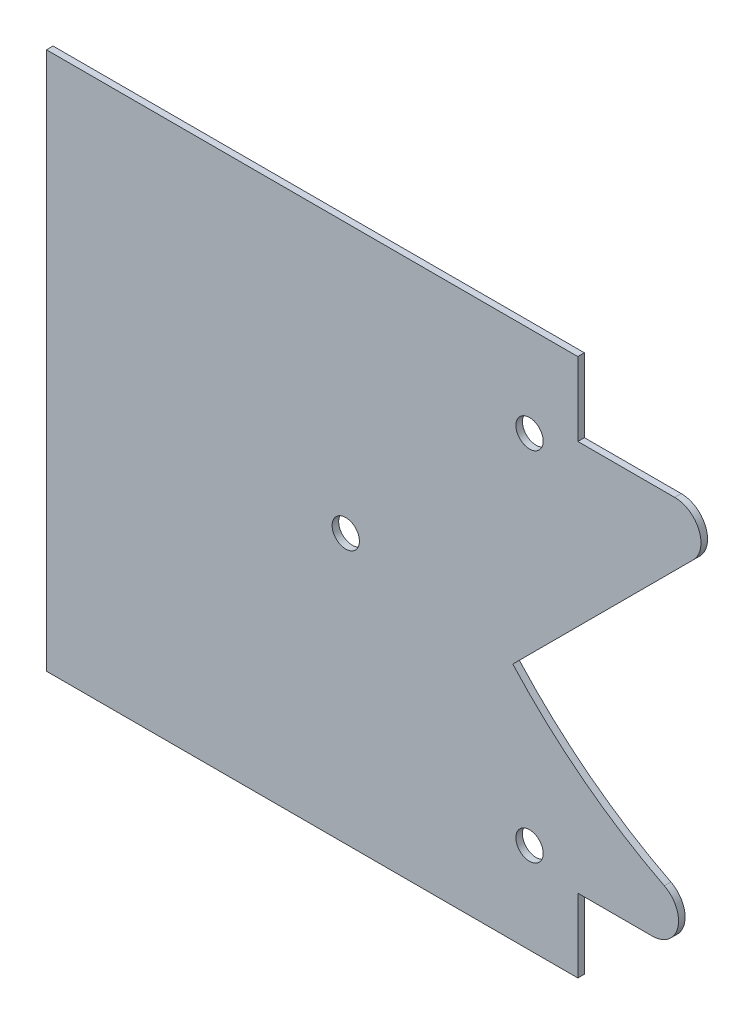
ISO-10303-21;
HEADER;
FILE_DESCRIPTION(('STEP AP214'),'2;1');
FILE_NAME('part.step','',(''),(''),'','','');
FILE_SCHEMA(('AUTOMOTIVE_DESIGN { 1 0 10303 214 1 1 1 1 }'));
ENDSEC;
DATA;
#1=APPLICATION_CONTEXT('core data for automotive mechanical design processes');
#2=APPLICATION_PROTOCOL_DEFINITION('international standard','automotive_design',2000,#1);
#3=PRODUCT_CONTEXT('',#1,'mechanical');
#4=PRODUCT('Part','Part','',(#3));
#5=PRODUCT_RELATED_PRODUCT_CATEGORY('part','',(#4));
#6=PRODUCT_DEFINITION_FORMATION('','',#4);
#7=PRODUCT_DEFINITION_CONTEXT('part definition',#1,'design');
#8=PRODUCT_DEFINITION('design','',#6,#7);
#9=PRODUCT_DEFINITION_SHAPE('','',#8);
#10=(LENGTH_UNIT() NAMED_UNIT(*) SI_UNIT(.MILLI.,.METRE.));
#11=(NAMED_UNIT(*) PLANE_ANGLE_UNIT() SI_UNIT($,.RADIAN.));
#12=(NAMED_UNIT(*) SI_UNIT($,.STERADIAN.) SOLID_ANGLE_UNIT());
#13=UNCERTAINTY_MEASURE_WITH_UNIT(LENGTH_MEASURE(1.E-05),#10,'distance_accuracy_value','');
#14=(GEOMETRIC_REPRESENTATION_CONTEXT(3) GLOBAL_UNCERTAINTY_ASSIGNED_CONTEXT((#13)) GLOBAL_UNIT_ASSIGNED_CONTEXT((#10,
#11,#12)) REPRESENTATION_CONTEXT('',''));
#15=CARTESIAN_POINT('',(0.,0.,0.));
#16=DIRECTION('',(0.,0.,1.));
#17=DIRECTION('',(1.,0.,0.));
#18=AXIS2_PLACEMENT_3D('',#15,#16,#17);
#19=CARTESIAN_POINT('',(0.,0.,0.79375));
#20=DIRECTION('',(0.,0.,-1.));
#21=DIRECTION('',(-1.,0.,0.));
#22=AXIS2_PLACEMENT_3D('',#19,#20,#21);
#23=PLANE('',#22);
#24=CARTESIAN_POINT('',(-67.945,0.,0.79375));
#25=DIRECTION('',(0.,0.,1.));
#26=DIRECTION('',(1.,0.,0.));
#27=AXIS2_PLACEMENT_3D('',#24,#25,#26);
#28=CIRCLE('',#27,1.65100000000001);
#29=CARTESIAN_POINT('',(-66.294,0.,0.79375));
#30=VERTEX_POINT('',#29);
#31=EDGE_CURVE('E152',#30,#30,#28,.T.);
#32=ORIENTED_EDGE('',*,*,#31,.F.);
#33=EDGE_LOOP('',(#32));
#34=FACE_BOUND('',#33,.T.);
#35=CARTESIAN_POINT('',(-45.72,-21.59,0.79375));
#36=DIRECTION('',(0.,0.,1.));
#37=DIRECTION('',(1.,0.,0.));
#38=AXIS2_PLACEMENT_3D('',#35,#36,#37);
#39=CIRCLE('',#38,1.651);
#40=CARTESIAN_POINT('',(-44.069,-21.59,0.79375));
#41=VERTEX_POINT('',#40);
#42=EDGE_CURVE('E174',#41,#41,#39,.T.);
#43=ORIENTED_EDGE('',*,*,#42,.F.);
#44=EDGE_LOOP('',(#43));
#45=FACE_BOUND('',#44,.T.);
#46=CARTESIAN_POINT('',(-45.72,21.59,0.79375));
#47=DIRECTION('',(0.,0.,1.));
#48=DIRECTION('',(1.,0.,0.));
#49=AXIS2_PLACEMENT_3D('',#46,#47,#48);
#50=CIRCLE('',#49,1.651);
#51=CARTESIAN_POINT('',(-44.069,21.59,0.79375));
#52=VERTEX_POINT('',#51);
#53=EDGE_CURVE('E180',#52,#52,#50,.T.);
#54=ORIENTED_EDGE('',*,*,#53,.F.);
#55=EDGE_LOOP('',(#54));
#56=FACE_BOUND('',#55,.T.);
#57=DIRECTION('',(1.,0.,0.));
#58=VECTOR('',#57,1.);
#59=CARTESIAN_POINT('',(0.,-23.65375,0.79375));
#60=LINE('',#59,#58);
#61=CARTESIAN_POINT('',(-39.878,-23.65375,0.79375));
#62=VERTEX_POINT('',#61);
#63=CARTESIAN_POINT('',(-30.8711406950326,-23.65375,0.79375));
#64=VERTEX_POINT('',#63);
#65=EDGE_CURVE('E133',#62,#64,#60,.T.);
#66=ORIENTED_EDGE('',*,*,#65,.T.);
#67=CARTESIAN_POINT('',(-30.8711406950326,-20.47875,0.79375));
#68=DIRECTION('',(0.,0.,-1.));
#69=DIRECTION('',(-1.,0.,0.));
#70=AXIS2_PLACEMENT_3D('',#67,#68,#69);
#71=CIRCLE('',#70,3.175);
#72=CARTESIAN_POINT('',(-29.4211106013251,-17.6542079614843,0.79375));
#73=VERTEX_POINT('',#72);
#74=EDGE_CURVE('E212',#64,#73,#71,.F.);
#75=ORIENTED_EDGE('',*,*,#74,.T.);
#76=CARTESIAN_POINT('',(0.,39.65575,0.79375));
#77=DIRECTION('',(0.,0.,1.));
#78=DIRECTION('',(1.,0.,0.));
#79=AXIS2_PLACEMENT_3D('',#76,#77,#78);
#80=CIRCLE('',#79,64.42075);
#81=CARTESIAN_POINT('',(-47.7420551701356,-3.5961771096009,0.79375));
#82=VERTEX_POINT('',#81);
#83=EDGE_CURVE('E164',#82,#73,#80,.T.);
#84=ORIENTED_EDGE('',*,*,#83,.F.);
#85=DIRECTION('',(-0.707106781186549,-0.707106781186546,0.));
#86=VECTOR('',#85,1.);
#87=CARTESIAN_POINT('',(-4.49012806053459,39.65575,0.79375));
#88=LINE('',#87,#86);
#89=CARTESIAN_POINT('',(-25.9121920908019,18.2336859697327,0.79375));
#90=VERTEX_POINT('',#89);
#91=EDGE_CURVE('E129',#90,#82,#88,.T.);
#92=ORIENTED_EDGE('',*,*,#91,.F.);
#93=CARTESIAN_POINT('',(-28.1572561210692,20.47875,0.79375));
#94=DIRECTION('',(0.,0.,-1.));
#95=DIRECTION('',(-1.,0.,0.));
#96=AXIS2_PLACEMENT_3D('',#93,#94,#95);
#97=CIRCLE('',#96,3.175);
#98=CARTESIAN_POINT('',(-28.1572561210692,23.65375,0.79375));
#99=VERTEX_POINT('',#98);
#100=EDGE_CURVE('E51',#90,#99,#97,.F.);
#101=ORIENTED_EDGE('',*,*,#100,.T.);
#102=DIRECTION('',(1.,0.,0.));
#103=VECTOR('',#102,1.);
#104=CARTESIAN_POINT('',(0.,23.65375,0.79375));
#105=LINE('',#104,#103);
#106=CARTESIAN_POINT('',(-39.878,23.65375,0.79375));
#107=VERTEX_POINT('',#106);
#108=EDGE_CURVE('E138',#107,#99,#105,.T.);
#109=ORIENTED_EDGE('',*,*,#108,.F.);
#110=DIRECTION('',(0.,-1.,0.));
#111=VECTOR('',#110,1.);
#112=CARTESIAN_POINT('',(-39.878,0.,0.79375));
#113=LINE('',#112,#111);
#114=CARTESIAN_POINT('',(-39.878,32.54375,0.79375));
#115=VERTEX_POINT('',#114);
#116=EDGE_CURVE('E143',#115,#107,#113,.T.);
#117=ORIENTED_EDGE('',*,*,#116,.F.);
#118=DIRECTION('',(-1.,0.,0.));
#119=VECTOR('',#118,1.);
#120=CARTESIAN_POINT('',(48.895,32.54375,0.79375));
#121=LINE('',#120,#119);
#122=CARTESIAN_POINT('',(-104.14,32.54375,0.79375));
#123=VERTEX_POINT('',#122);
#124=EDGE_CURVE('E186',#115,#123,#121,.T.);
#125=ORIENTED_EDGE('',*,*,#124,.T.);
#126=DIRECTION('',(0.,-1.,0.));
#127=VECTOR('',#126,1.);
#128=CARTESIAN_POINT('',(-104.14,32.54375,0.79375));
#129=LINE('',#128,#127);
#130=CARTESIAN_POINT('',(-104.14,-32.54375,0.79375));
#131=VERTEX_POINT('',#130);
#132=EDGE_CURVE('E188',#123,#131,#129,.T.);
#133=ORIENTED_EDGE('',*,*,#132,.T.);
#134=DIRECTION('',(1.,0.,0.));
#135=VECTOR('',#134,1.);
#136=CARTESIAN_POINT('',(48.895,-32.54375,0.79375));
#137=LINE('',#136,#135);
#138=CARTESIAN_POINT('',(-39.878,-32.54375,0.79375));
#139=VERTEX_POINT('',#138);
#140=EDGE_CURVE('E142',#131,#139,#137,.T.);
#141=ORIENTED_EDGE('',*,*,#140,.T.);
#142=EDGE_CURVE('E122',#62,#139,#113,.T.);
#143=ORIENTED_EDGE('',*,*,#142,.F.);
#144=EDGE_LOOP('',(#66,#75,#84,#92,#101,#109,#117,#125,#133,#141,#143));
#145=FACE_BOUND('',#144,.T.);
#146=ADVANCED_FACE('F36',(#34,#45,#56,#145),#23,.F.);
#147=CARTESIAN_POINT('',(0.,0.,0.));
#148=DIRECTION('',(0.,0.,-1.));
#149=DIRECTION('',(-1.,0.,0.));
#150=AXIS2_PLACEMENT_3D('',#147,#148,#149);
#151=PLANE('',#150);
#152=CARTESIAN_POINT('',(-67.945,0.,0.));
#153=DIRECTION('',(0.,0.,1.));
#154=DIRECTION('',(1.,0.,0.));
#155=AXIS2_PLACEMENT_3D('',#152,#153,#154);
#156=CIRCLE('',#155,1.65100000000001);
#157=CARTESIAN_POINT('',(-66.294,0.,0.));
#158=VERTEX_POINT('',#157);
#159=EDGE_CURVE('E228',#158,#158,#156,.T.);
#160=ORIENTED_EDGE('',*,*,#159,.T.);
#161=EDGE_LOOP('',(#160));
#162=FACE_BOUND('',#161,.T.);
#163=CARTESIAN_POINT('',(0.,39.65575,0.));
#164=DIRECTION('',(0.,0.,1.));
#165=DIRECTION('',(-1.,0.,0.));
#166=AXIS2_PLACEMENT_3D('',#163,#164,#165);
#167=CIRCLE('',#166,64.42075);
#168=CARTESIAN_POINT('',(-47.7420551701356,-3.5961771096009,0.));
#169=VERTEX_POINT('',#168);
#170=CARTESIAN_POINT('',(-29.4211106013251,-17.6542079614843,0.));
#171=VERTEX_POINT('',#170);
#172=EDGE_CURVE('E163',#169,#171,#167,.T.);
#173=ORIENTED_EDGE('',*,*,#172,.T.);
#174=CARTESIAN_POINT('',(-30.8711406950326,-20.47875,0.));
#175=DIRECTION('',(0.,0.,-1.));
#176=DIRECTION('',(-1.,0.,0.));
#177=AXIS2_PLACEMENT_3D('',#174,#175,#176);
#178=CIRCLE('',#177,3.175);
#179=CARTESIAN_POINT('',(-30.8711406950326,-23.65375,0.));
#180=VERTEX_POINT('',#179);
#181=EDGE_CURVE('E208',#171,#180,#178,.T.);
#182=ORIENTED_EDGE('',*,*,#181,.T.);
#183=DIRECTION('',(1.,0.,0.));
#184=VECTOR('',#183,1.);
#185=CARTESIAN_POINT('',(0.,-23.65375,0.));
#186=LINE('',#185,#184);
#187=CARTESIAN_POINT('',(-39.878,-23.65375,0.));
#188=VERTEX_POINT('',#187);
#189=EDGE_CURVE('E151',#188,#180,#186,.T.);
#190=ORIENTED_EDGE('',*,*,#189,.F.);
#191=DIRECTION('',(0.,-1.,0.));
#192=VECTOR('',#191,1.);
#193=CARTESIAN_POINT('',(-39.878,0.,0.));
#194=LINE('',#193,#192);
#195=CARTESIAN_POINT('',(-39.878,-32.54375,0.));
#196=VERTEX_POINT('',#195);
#197=EDGE_CURVE('E125',#188,#196,#194,.T.);
#198=ORIENTED_EDGE('',*,*,#197,.T.);
#199=DIRECTION('',(1.,0.,0.));
#200=VECTOR('',#199,1.);
#201=CARTESIAN_POINT('',(48.895,-32.54375,0.));
#202=LINE('',#201,#200);
#203=CARTESIAN_POINT('',(-104.14,-32.54375,0.));
#204=VERTEX_POINT('',#203);
#205=EDGE_CURVE('E189',#204,#196,#202,.T.);
#206=ORIENTED_EDGE('',*,*,#205,.F.);
#207=DIRECTION('',(0.,-1.,0.));
#208=VECTOR('',#207,1.);
#209=CARTESIAN_POINT('',(-104.14,32.54375,0.));
#210=LINE('',#209,#208);
#211=CARTESIAN_POINT('',(-104.14,32.54375,0.));
#212=VERTEX_POINT('',#211);
#213=EDGE_CURVE('E194',#212,#204,#210,.T.);
#214=ORIENTED_EDGE('',*,*,#213,.F.);
#215=DIRECTION('',(-1.,0.,0.));
#216=VECTOR('',#215,1.);
#217=CARTESIAN_POINT('',(48.895,32.54375,0.));
#218=LINE('',#217,#216);
#219=CARTESIAN_POINT('',(-39.878,32.54375,0.));
#220=VERTEX_POINT('',#219);
#221=EDGE_CURVE('E183',#220,#212,#218,.T.);
#222=ORIENTED_EDGE('',*,*,#221,.F.);
#223=CARTESIAN_POINT('',(-39.878,23.65375,0.));
#224=VERTEX_POINT('',#223);
#225=EDGE_CURVE('E155',#220,#224,#194,.T.);
#226=ORIENTED_EDGE('',*,*,#225,.T.);
#227=DIRECTION('',(1.,0.,0.));
#228=VECTOR('',#227,1.);
#229=CARTESIAN_POINT('',(0.,23.65375,0.));
#230=LINE('',#229,#228);
#231=CARTESIAN_POINT('',(-28.1572561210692,23.65375,0.));
#232=VERTEX_POINT('',#231);
#233=EDGE_CURVE('E148',#224,#232,#230,.T.);
#234=ORIENTED_EDGE('',*,*,#233,.T.);
#235=CARTESIAN_POINT('',(-28.1572561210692,20.47875,0.));
#236=DIRECTION('',(0.,0.,-1.));
#237=DIRECTION('',(-1.,0.,0.));
#238=AXIS2_PLACEMENT_3D('',#235,#236,#237);
#239=CIRCLE('',#238,3.175);
#240=CARTESIAN_POINT('',(-25.9121920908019,18.2336859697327,0.));
#241=VERTEX_POINT('',#240);
#242=EDGE_CURVE('E206',#232,#241,#239,.T.);
#243=ORIENTED_EDGE('',*,*,#242,.T.);
#244=DIRECTION('',(-0.707106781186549,-0.707106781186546,0.));
#245=VECTOR('',#244,1.);
#246=CARTESIAN_POINT('',(-4.49012806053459,39.65575,0.));
#247=LINE('',#246,#245);
#248=EDGE_CURVE('E161',#241,#169,#247,.T.);
#249=ORIENTED_EDGE('',*,*,#248,.T.);
#250=EDGE_LOOP('',(#173,#182,#190,#198,#206,#214,#222,#226,#234,#243,#249));
#251=FACE_BOUND('',#250,.T.);
#252=CARTESIAN_POINT('',(-45.72,-21.59,0.));
#253=DIRECTION('',(0.,0.,1.));
#254=DIRECTION('',(1.,0.,0.));
#255=AXIS2_PLACEMENT_3D('',#252,#253,#254);
#256=CIRCLE('',#255,1.651);
#257=CARTESIAN_POINT('',(-44.069,-21.59,0.));
#258=VERTEX_POINT('',#257);
#259=EDGE_CURVE('E173',#258,#258,#256,.T.);
#260=ORIENTED_EDGE('',*,*,#259,.T.);
#261=EDGE_LOOP('',(#260));
#262=FACE_BOUND('',#261,.T.);
#263=CARTESIAN_POINT('',(-45.72,21.59,0.));
#264=DIRECTION('',(0.,0.,1.));
#265=DIRECTION('',(1.,0.,0.));
#266=AXIS2_PLACEMENT_3D('',#263,#264,#265);
#267=CIRCLE('',#266,1.651);
#268=CARTESIAN_POINT('',(-44.069,21.59,0.));
#269=VERTEX_POINT('',#268);
#270=EDGE_CURVE('E177',#269,#269,#267,.T.);
#271=ORIENTED_EDGE('',*,*,#270,.T.);
#272=EDGE_LOOP('',(#271));
#273=FACE_BOUND('',#272,.T.);
#274=ADVANCED_FACE('F222',(#162,#251,#262,#273),#151,.T.);
#275=CARTESIAN_POINT('',(48.895,32.54375,0.79375));
#276=DIRECTION('',(0.,-1.,0.));
#277=DIRECTION('',(1.,0.,0.));
#278=AXIS2_PLACEMENT_3D('',#275,#276,#277);
#279=PLANE('',#278);
#280=DIRECTION('',(0.,0.,-1.));
#281=VECTOR('',#280,1.);
#282=CARTESIAN_POINT('',(-39.878,32.54375,0.79375));
#283=LINE('',#282,#281);
#284=EDGE_CURVE('E157',#115,#220,#283,.T.);
#285=ORIENTED_EDGE('',*,*,#284,.T.);
#286=ORIENTED_EDGE('',*,*,#221,.T.);
#287=DIRECTION('',(0.,0.,-1.));
#288=VECTOR('',#287,1.);
#289=CARTESIAN_POINT('',(-104.14,32.54375,0.79375));
#290=LINE('',#289,#288);
#291=EDGE_CURVE('E200',#123,#212,#290,.T.);
#292=ORIENTED_EDGE('',*,*,#291,.F.);
#293=ORIENTED_EDGE('',*,*,#124,.F.);
#294=EDGE_LOOP('',(#285,#286,#292,#293));
#295=FACE_BOUND('',#294,.T.);
#296=ADVANCED_FACE('F253',(#295),#279,.F.);
#297=CARTESIAN_POINT('',(48.895,-32.54375,0.79375));
#298=DIRECTION('',(0.,1.,0.));
#299=DIRECTION('',(-1.,0.,0.));
#300=AXIS2_PLACEMENT_3D('',#297,#298,#299);
#301=PLANE('',#300);
#302=DIRECTION('',(0.,0.,-1.));
#303=VECTOR('',#302,1.);
#304=CARTESIAN_POINT('',(-39.878,-32.54375,0.79375));
#305=LINE('',#304,#303);
#306=EDGE_CURVE('E130',#139,#196,#305,.T.);
#307=ORIENTED_EDGE('',*,*,#306,.F.);
#308=ORIENTED_EDGE('',*,*,#140,.F.);
#309=DIRECTION('',(0.,0.,-1.));
#310=VECTOR('',#309,1.);
#311=CARTESIAN_POINT('',(-104.14,-32.54375,0.79375));
#312=LINE('',#311,#310);
#313=EDGE_CURVE('E192',#131,#204,#312,.T.);
#314=ORIENTED_EDGE('',*,*,#313,.T.);
#315=ORIENTED_EDGE('',*,*,#205,.T.);
#316=EDGE_LOOP('',(#307,#308,#314,#315));
#317=FACE_BOUND('',#316,.T.);
#318=ADVANCED_FACE('F259',(#317),#301,.F.);
#319=CARTESIAN_POINT('',(-4.49012806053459,39.65575,0.));
#320=DIRECTION('',(-0.707106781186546,0.707106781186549,0.));
#321=DIRECTION('',(-0.707106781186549,-0.707106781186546,0.));
#322=AXIS2_PLACEMENT_3D('',#319,#320,#321);
#323=PLANE('',#322);
#324=ORIENTED_EDGE('',*,*,#248,.F.);
#325=DIRECTION('',(0.,0.,-1.));
#326=VECTOR('',#325,1.);
#327=CARTESIAN_POINT('',(-25.9121920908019,18.2336859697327,0.79375));
#328=LINE('',#327,#326);
#329=EDGE_CURVE('E11',#241,#90,#328,.F.);
#330=ORIENTED_EDGE('',*,*,#329,.T.);
#331=ORIENTED_EDGE('',*,*,#91,.T.);
#332=DIRECTION('',(0.,0.,1.));
#333=VECTOR('',#332,1.);
#334=CARTESIAN_POINT('',(-47.7420551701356,-3.5961771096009,0.));
#335=LINE('',#334,#333);
#336=EDGE_CURVE('E167',#169,#82,#335,.T.);
#337=ORIENTED_EDGE('',*,*,#336,.F.);
#338=EDGE_LOOP('',(#324,#330,#331,#337));
#339=FACE_BOUND('',#338,.T.);
#340=ADVANCED_FACE('F265',(#339),#323,.F.);
#341=CARTESIAN_POINT('',(-104.14,32.54375,0.79375));
#342=DIRECTION('',(1.,0.,0.));
#343=DIRECTION('',(0.,0.,-1.));
#344=AXIS2_PLACEMENT_3D('',#341,#342,#343);
#345=PLANE('',#344);
#346=ORIENTED_EDGE('',*,*,#213,.T.);
#347=ORIENTED_EDGE('',*,*,#313,.F.);
#348=ORIENTED_EDGE('',*,*,#132,.F.);
#349=ORIENTED_EDGE('',*,*,#291,.T.);
#350=EDGE_LOOP('',(#346,#347,#348,#349));
#351=FACE_BOUND('',#350,.T.);
#352=ADVANCED_FACE('F248',(#351),#345,.F.);
#353=CARTESIAN_POINT('',(-45.72,21.59,0.79375));
#354=DIRECTION('',(0.,0.,-1.));
#355=DIRECTION('',(-1.,0.,0.));
#356=AXIS2_PLACEMENT_3D('',#353,#354,#355);
#357=CYLINDRICAL_SURFACE('',#356,1.651);
#358=ORIENTED_EDGE('',*,*,#53,.T.);
#359=EDGE_LOOP('',(#358));
#360=FACE_BOUND('',#359,.T.);
#361=ORIENTED_EDGE('',*,*,#270,.F.);
#362=EDGE_LOOP('',(#361));
#363=FACE_BOUND('',#362,.T.);
#364=ADVANCED_FACE('F244',(#360,#363),#357,.F.);
#365=CARTESIAN_POINT('',(-45.72,-21.59,0.79375));
#366=DIRECTION('',(0.,0.,-1.));
#367=DIRECTION('',(-1.,0.,0.));
#368=AXIS2_PLACEMENT_3D('',#365,#366,#367);
#369=CYLINDRICAL_SURFACE('',#368,1.651);
#370=ORIENTED_EDGE('',*,*,#42,.T.);
#371=EDGE_LOOP('',(#370));
#372=FACE_BOUND('',#371,.T.);
#373=ORIENTED_EDGE('',*,*,#259,.F.);
#374=EDGE_LOOP('',(#373));
#375=FACE_BOUND('',#374,.T.);
#376=ADVANCED_FACE('F247',(#372,#375),#369,.F.);
#377=CARTESIAN_POINT('',(0.,39.65575,0.));
#378=DIRECTION('',(0.,0.,1.));
#379=DIRECTION('',(1.,0.,0.));
#380=AXIS2_PLACEMENT_3D('',#377,#378,#379);
#381=CYLINDRICAL_SURFACE('',#380,64.42075);
#382=ORIENTED_EDGE('',*,*,#83,.T.);
#383=DIRECTION('',(0.,0.,1.));
#384=VECTOR('',#383,1.);
#385=CARTESIAN_POINT('',(-29.4211106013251,-17.6542079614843,0.));
#386=LINE('',#385,#384);
#387=EDGE_CURVE('E203',#73,#171,#386,.F.);
#388=ORIENTED_EDGE('',*,*,#387,.T.);
#389=ORIENTED_EDGE('',*,*,#172,.F.);
#390=ORIENTED_EDGE('',*,*,#336,.T.);
#391=EDGE_LOOP('',(#382,#388,#389,#390));
#392=FACE_BOUND('',#391,.T.);
#393=ADVANCED_FACE('F281',(#392),#381,.F.);
#394=CARTESIAN_POINT('',(0.,-23.65375,0.79375));
#395=DIRECTION('',(0.,1.,0.));
#396=DIRECTION('',(0.,0.,1.));
#397=AXIS2_PLACEMENT_3D('',#394,#395,#396);
#398=PLANE('',#397);
#399=ORIENTED_EDGE('',*,*,#189,.T.);
#400=DIRECTION('',(0.,0.,1.));
#401=VECTOR('',#400,1.);
#402=CARTESIAN_POINT('',(-30.8711406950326,-23.65375,0.79375));
#403=LINE('',#402,#401);
#404=EDGE_CURVE('E136',#180,#64,#403,.T.);
#405=ORIENTED_EDGE('',*,*,#404,.T.);
#406=ORIENTED_EDGE('',*,*,#65,.F.);
#407=DIRECTION('',(0.,0.,-1.));
#408=VECTOR('',#407,1.);
#409=CARTESIAN_POINT('',(-39.878,-23.65375,0.79375));
#410=LINE('',#409,#408);
#411=EDGE_CURVE('E118',#62,#188,#410,.T.);
#412=ORIENTED_EDGE('',*,*,#411,.T.);
#413=EDGE_LOOP('',(#399,#405,#406,#412));
#414=FACE_BOUND('',#413,.T.);
#415=ADVANCED_FACE('F134',(#414),#398,.F.);
#416=CARTESIAN_POINT('',(-39.878,0.,0.79375));
#417=DIRECTION('',(1.,0.,0.));
#418=DIRECTION('',(0.,1.,0.));
#419=AXIS2_PLACEMENT_3D('',#416,#417,#418);
#420=PLANE('',#419);
#421=ORIENTED_EDGE('',*,*,#197,.F.);
#422=ORIENTED_EDGE('',*,*,#411,.F.);
#423=ORIENTED_EDGE('',*,*,#142,.T.);
#424=ORIENTED_EDGE('',*,*,#306,.T.);
#425=EDGE_LOOP('',(#421,#422,#423,#424));
#426=FACE_BOUND('',#425,.T.);
#427=ADVANCED_FACE('F120',(#426),#420,.T.);
#428=CARTESIAN_POINT('',(0.,23.65375,0.79375));
#429=DIRECTION('',(0.,1.,0.));
#430=DIRECTION('',(0.,0.,1.));
#431=AXIS2_PLACEMENT_3D('',#428,#429,#430);
#432=PLANE('',#431);
#433=ORIENTED_EDGE('',*,*,#108,.T.);
#434=DIRECTION('',(0.,0.,-1.));
#435=VECTOR('',#434,1.);
#436=CARTESIAN_POINT('',(-28.1572561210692,23.65375,0.));
#437=LINE('',#436,#435);
#438=EDGE_CURVE('E44',#99,#232,#437,.T.);
#439=ORIENTED_EDGE('',*,*,#438,.T.);
#440=ORIENTED_EDGE('',*,*,#233,.F.);
#441=DIRECTION('',(0.,0.,-1.));
#442=VECTOR('',#441,1.);
#443=CARTESIAN_POINT('',(-39.878,23.65375,0.79375));
#444=LINE('',#443,#442);
#445=EDGE_CURVE('E145',#107,#224,#444,.T.);
#446=ORIENTED_EDGE('',*,*,#445,.F.);
#447=EDGE_LOOP('',(#433,#439,#440,#446));
#448=FACE_BOUND('',#447,.T.);
#449=ADVANCED_FACE('F217',(#448),#432,.T.);
#450=ORIENTED_EDGE('',*,*,#225,.F.);
#451=ORIENTED_EDGE('',*,*,#284,.F.);
#452=ORIENTED_EDGE('',*,*,#116,.T.);
#453=ORIENTED_EDGE('',*,*,#445,.T.);
#454=EDGE_LOOP('',(#450,#451,#452,#453));
#455=FACE_BOUND('',#454,.T.);
#456=ADVANCED_FACE('F276',(#455),#420,.T.);
#457=CARTESIAN_POINT('',(-67.945,0.,0.79375));
#458=DIRECTION('',(0.,0.,-1.));
#459=DIRECTION('',(-1.,0.,0.));
#460=AXIS2_PLACEMENT_3D('',#457,#458,#459);
#461=CYLINDRICAL_SURFACE('',#460,1.65100000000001);
#462=ORIENTED_EDGE('',*,*,#31,.T.);
#463=EDGE_LOOP('',(#462));
#464=FACE_BOUND('',#463,.T.);
#465=ORIENTED_EDGE('',*,*,#159,.F.);
#466=EDGE_LOOP('',(#465));
#467=FACE_BOUND('',#466,.T.);
#468=ADVANCED_FACE('F234',(#464,#467),#461,.F.);
#469=CARTESIAN_POINT('',(-30.8711406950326,-20.47875,0.));
#470=DIRECTION('',(0.,0.,1.));
#471=DIRECTION('',(1.,0.,0.));
#472=AXIS2_PLACEMENT_3D('',#469,#470,#471);
#473=CYLINDRICAL_SURFACE('',#472,3.175);
#474=ORIENTED_EDGE('',*,*,#74,.F.);
#475=ORIENTED_EDGE('',*,*,#404,.F.);
#476=ORIENTED_EDGE('',*,*,#181,.F.);
#477=ORIENTED_EDGE('',*,*,#387,.F.);
#478=EDGE_LOOP('',(#474,#475,#476,#477));
#479=FACE_BOUND('',#478,.T.);
#480=ADVANCED_FACE('F269',(#479),#473,.T.);
#481=CARTESIAN_POINT('',(-28.1572561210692,20.47875,0.79375));
#482=DIRECTION('',(0.,0.,1.));
#483=DIRECTION('',(1.,0.,0.));
#484=AXIS2_PLACEMENT_3D('',#481,#482,#483);
#485=CYLINDRICAL_SURFACE('',#484,3.175);
#486=ORIENTED_EDGE('',*,*,#100,.F.);
#487=ORIENTED_EDGE('',*,*,#329,.F.);
#488=ORIENTED_EDGE('',*,*,#242,.F.);
#489=ORIENTED_EDGE('',*,*,#438,.F.);
#490=EDGE_LOOP('',(#486,#487,#488,#489));
#491=FACE_BOUND('',#490,.T.);
#492=ADVANCED_FACE('F38',(#491),#485,.T.);
#493=CLOSED_SHELL('',(#146,#274,#296,#318,#340,#352,#364,#376,#393,#415,#427,#449,#456,#468,
#480,#492));
#494=MANIFOLD_SOLID_BREP('B2',#493);
#495=ADVANCED_BREP_SHAPE_REPRESENTATION('',(#18,#494),#14);
#496=SHAPE_DEFINITION_REPRESENTATION(#9,#495);
ENDSEC;
END-ISO-10303-21;
